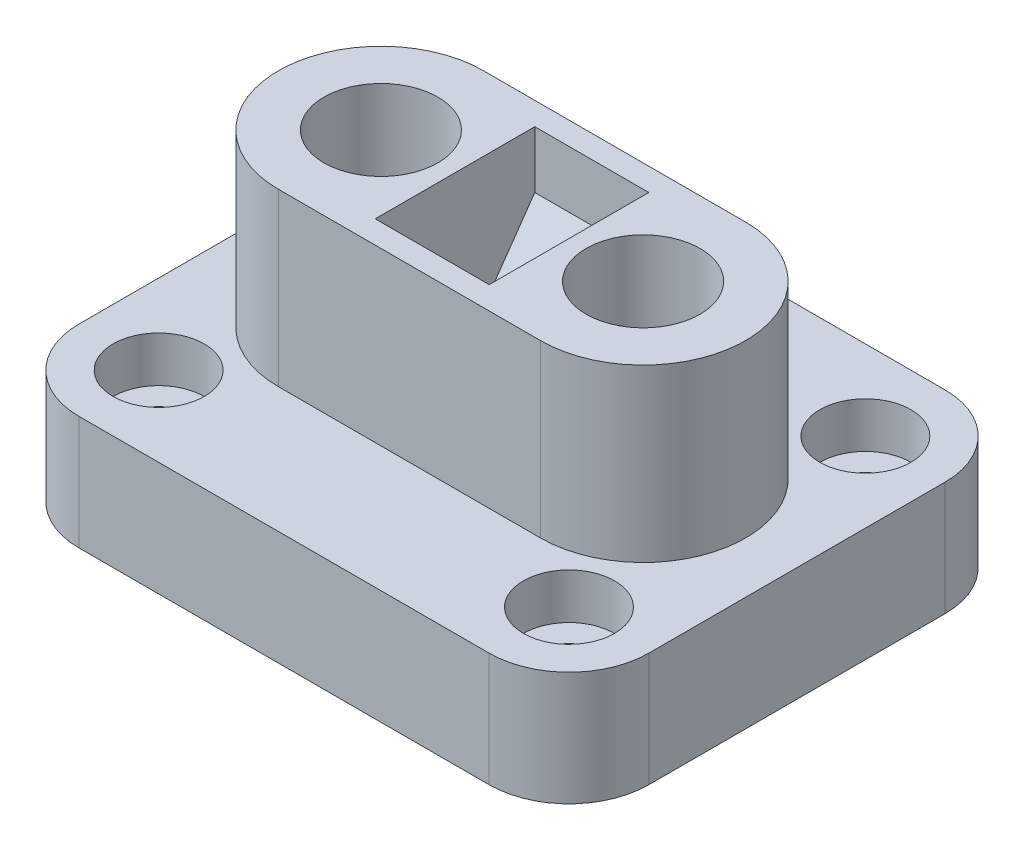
ISO-10303-21;
HEADER;
FILE_DESCRIPTION(('STEP AP214'),'2;1');
FILE_NAME('part.step','',(''),(''),'','','');
FILE_SCHEMA(('AUTOMOTIVE_DESIGN { 1 0 10303 214 1 1 1 1 }'));
ENDSEC;
DATA;
#1=APPLICATION_CONTEXT('core data for automotive mechanical design processes');
#2=APPLICATION_PROTOCOL_DEFINITION('international standard','automotive_design',2000,#1);
#3=PRODUCT_CONTEXT('',#1,'mechanical');
#4=PRODUCT('Part','Part','',(#3));
#5=PRODUCT_RELATED_PRODUCT_CATEGORY('part','',(#4));
#6=PRODUCT_DEFINITION_FORMATION('','',#4);
#7=PRODUCT_DEFINITION_CONTEXT('part definition',#1,'design');
#8=PRODUCT_DEFINITION('design','',#6,#7);
#9=PRODUCT_DEFINITION_SHAPE('','',#8);
#10=(LENGTH_UNIT() NAMED_UNIT(*) SI_UNIT(.MILLI.,.METRE.));
#11=(NAMED_UNIT(*) PLANE_ANGLE_UNIT() SI_UNIT($,.RADIAN.));
#12=(NAMED_UNIT(*) SI_UNIT($,.STERADIAN.) SOLID_ANGLE_UNIT());
#13=UNCERTAINTY_MEASURE_WITH_UNIT(LENGTH_MEASURE(1.E-05),#10,'distance_accuracy_value','');
#14=(GEOMETRIC_REPRESENTATION_CONTEXT(3) GLOBAL_UNCERTAINTY_ASSIGNED_CONTEXT((#13)) GLOBAL_UNIT_ASSIGNED_CONTEXT((#10,
#11,#12)) REPRESENTATION_CONTEXT('',''));
#15=CARTESIAN_POINT('',(0.,0.,0.));
#16=DIRECTION('',(0.,0.,1.));
#17=DIRECTION('',(1.,0.,0.));
#18=AXIS2_PLACEMENT_3D('',#15,#16,#17);
#19=CARTESIAN_POINT('',(-50.,20.,40.));
#20=DIRECTION('',(0.,1.,0.));
#21=DIRECTION('',(0.,0.,1.));
#22=AXIS2_PLACEMENT_3D('',#19,#20,#21);
#23=PLANE('',#22);
#24=CARTESIAN_POINT('',(36.,20.,-26.));
#25=DIRECTION('',(0.,1.,0.));
#26=DIRECTION('',(0.,0.,1.));
#27=AXIS2_PLACEMENT_3D('',#24,#25,#26);
#28=CIRCLE('',#27,8.);
#29=CARTESIAN_POINT('',(36.,20.,-18.));
#30=VERTEX_POINT('',#29);
#31=EDGE_CURVE('E228',#30,#30,#28,.T.);
#32=ORIENTED_EDGE('',*,*,#31,.F.);
#33=EDGE_LOOP('',(#32));
#34=FACE_BOUND('',#33,.T.);
#35=CARTESIAN_POINT('',(-36.,20.,-26.));
#36=DIRECTION('',(0.,1.,0.));
#37=DIRECTION('',(0.,0.,1.));
#38=AXIS2_PLACEMENT_3D('',#35,#36,#37);
#39=CIRCLE('',#38,8.);
#40=CARTESIAN_POINT('',(-36.,20.,-18.));
#41=VERTEX_POINT('',#40);
#42=EDGE_CURVE('E251',#41,#41,#39,.T.);
#43=ORIENTED_EDGE('',*,*,#42,.F.);
#44=EDGE_LOOP('',(#43));
#45=FACE_BOUND('',#44,.T.);
#46=CARTESIAN_POINT('',(36.,20.,26.));
#47=DIRECTION('',(0.,1.,0.));
#48=DIRECTION('',(0.,0.,1.));
#49=AXIS2_PLACEMENT_3D('',#46,#47,#48);
#50=CIRCLE('',#49,8.);
#51=CARTESIAN_POINT('',(36.,20.,34.));
#52=VERTEX_POINT('',#51);
#53=EDGE_CURVE('E263',#52,#52,#50,.T.);
#54=ORIENTED_EDGE('',*,*,#53,.F.);
#55=EDGE_LOOP('',(#54));
#56=FACE_BOUND('',#55,.T.);
#57=CARTESIAN_POINT('',(-36.,20.,26.));
#58=DIRECTION('',(0.,1.,0.));
#59=DIRECTION('',(0.,0.,1.));
#60=AXIS2_PLACEMENT_3D('',#57,#58,#59);
#61=CIRCLE('',#60,8.);
#62=CARTESIAN_POINT('',(-36.,20.,34.));
#63=VERTEX_POINT('',#62);
#64=EDGE_CURVE('E275',#63,#63,#61,.T.);
#65=ORIENTED_EDGE('',*,*,#64,.F.);
#66=EDGE_LOOP('',(#65));
#67=FACE_BOUND('',#66,.T.);
#68=DIRECTION('',(-1.,0.,0.));
#69=VECTOR('',#68,1.);
#70=CARTESIAN_POINT('',(-50.,20.,-40.));
#71=LINE('',#70,#69);
#72=CARTESIAN_POINT('',(36.,20.,-40.));
#73=VERTEX_POINT('',#72);
#74=CARTESIAN_POINT('',(-36.,20.,-40.));
#75=VERTEX_POINT('',#74);
#76=EDGE_CURVE('E349',#73,#75,#71,.T.);
#77=ORIENTED_EDGE('',*,*,#76,.T.);
#78=CARTESIAN_POINT('',(-36.,20.,-26.));
#79=DIRECTION('',(0.,1.,0.));
#80=DIRECTION('',(0.,0.,1.));
#81=AXIS2_PLACEMENT_3D('',#78,#79,#80);
#82=CIRCLE('',#81,14.);
#83=CARTESIAN_POINT('',(-50.,20.,-26.));
#84=VERTEX_POINT('',#83);
#85=EDGE_CURVE('E376',#75,#84,#82,.T.);
#86=ORIENTED_EDGE('',*,*,#85,.T.);
#87=DIRECTION('',(0.,0.,1.));
#88=VECTOR('',#87,1.);
#89=CARTESIAN_POINT('',(-50.,20.,-40.));
#90=LINE('',#89,#88);
#91=CARTESIAN_POINT('',(-50.,20.,26.));
#92=VERTEX_POINT('',#91);
#93=EDGE_CURVE('E340',#84,#92,#90,.T.);
#94=ORIENTED_EDGE('',*,*,#93,.T.);
#95=CARTESIAN_POINT('',(-36.,20.,26.));
#96=DIRECTION('',(0.,1.,0.));
#97=DIRECTION('',(0.,0.,1.));
#98=AXIS2_PLACEMENT_3D('',#95,#96,#97);
#99=CIRCLE('',#98,14.);
#100=CARTESIAN_POINT('',(-36.,20.,40.));
#101=VERTEX_POINT('',#100);
#102=EDGE_CURVE('E370',#92,#101,#99,.T.);
#103=ORIENTED_EDGE('',*,*,#102,.T.);
#104=DIRECTION('',(1.,0.,0.));
#105=VECTOR('',#104,1.);
#106=CARTESIAN_POINT('',(-50.,20.,40.));
#107=LINE('',#106,#105);
#108=CARTESIAN_POINT('',(36.,20.,40.));
#109=VERTEX_POINT('',#108);
#110=EDGE_CURVE('E343',#101,#109,#107,.T.);
#111=ORIENTED_EDGE('',*,*,#110,.T.);
#112=CARTESIAN_POINT('',(36.,20.,26.));
#113=DIRECTION('',(0.,1.,0.));
#114=DIRECTION('',(0.,0.,1.));
#115=AXIS2_PLACEMENT_3D('',#112,#113,#114);
#116=CIRCLE('',#115,14.);
#117=CARTESIAN_POINT('',(50.,20.,26.));
#118=VERTEX_POINT('',#117);
#119=EDGE_CURVE('E372',#109,#118,#116,.T.);
#120=ORIENTED_EDGE('',*,*,#119,.T.);
#121=DIRECTION('',(0.,0.,-1.));
#122=VECTOR('',#121,1.);
#123=CARTESIAN_POINT('',(50.,20.,-40.));
#124=LINE('',#123,#122);
#125=CARTESIAN_POINT('',(50.,20.,-26.));
#126=VERTEX_POINT('',#125);
#127=EDGE_CURVE('E346',#118,#126,#124,.T.);
#128=ORIENTED_EDGE('',*,*,#127,.T.);
#129=CARTESIAN_POINT('',(36.,20.,-26.));
#130=DIRECTION('',(0.,1.,0.));
#131=DIRECTION('',(0.,0.,1.));
#132=AXIS2_PLACEMENT_3D('',#129,#130,#131);
#133=CIRCLE('',#132,14.);
#134=EDGE_CURVE('E374',#126,#73,#133,.T.);
#135=ORIENTED_EDGE('',*,*,#134,.T.);
#136=EDGE_LOOP('',(#77,#86,#94,#103,#111,#120,#128,#135));
#137=FACE_BOUND('',#136,.T.);
#138=DIRECTION('',(-1.,0.,0.));
#139=VECTOR('',#138,1.);
#140=CARTESIAN_POINT('',(23.,20.,-18.));
#141=LINE('',#140,#139);
#142=CARTESIAN_POINT('',(23.,20.,-18.));
#143=VERTEX_POINT('',#142);
#144=CARTESIAN_POINT('',(-23.,20.,-18.));
#145=VERTEX_POINT('',#144);
#146=EDGE_CURVE('E302',#143,#145,#141,.T.);
#147=ORIENTED_EDGE('',*,*,#146,.F.);
#148=CARTESIAN_POINT('',(23.,20.,0.));
#149=DIRECTION('',(0.,1.,0.));
#150=DIRECTION('',(0.,0.,1.));
#151=AXIS2_PLACEMENT_3D('',#148,#149,#150);
#152=CIRCLE('',#151,18.);
#153=CARTESIAN_POINT('',(23.,20.,18.));
#154=VERTEX_POINT('',#153);
#155=EDGE_CURVE('E299',#154,#143,#152,.T.);
#156=ORIENTED_EDGE('',*,*,#155,.F.);
#157=DIRECTION('',(1.,0.,0.));
#158=VECTOR('',#157,1.);
#159=CARTESIAN_POINT('',(-23.,20.,18.));
#160=LINE('',#159,#158);
#161=CARTESIAN_POINT('',(-23.,20.,18.));
#162=VERTEX_POINT('',#161);
#163=EDGE_CURVE('E307',#162,#154,#160,.T.);
#164=ORIENTED_EDGE('',*,*,#163,.F.);
#165=CARTESIAN_POINT('',(-23.,20.,0.));
#166=DIRECTION('',(0.,1.,0.));
#167=DIRECTION('',(0.,0.,1.));
#168=AXIS2_PLACEMENT_3D('',#165,#166,#167);
#169=CIRCLE('',#168,18.);
#170=EDGE_CURVE('E304',#145,#162,#169,.T.);
#171=ORIENTED_EDGE('',*,*,#170,.F.);
#172=EDGE_LOOP('',(#147,#156,#164,#171));
#173=FACE_BOUND('',#172,.T.);
#174=ADVANCED_FACE('F34',(#34,#45,#56,#67,#137,#173),#23,.T.);
#175=CARTESIAN_POINT('',(-50.,20.,-40.));
#176=DIRECTION('',(1.,0.,0.));
#177=DIRECTION('',(0.,0.,-1.));
#178=AXIS2_PLACEMENT_3D('',#175,#176,#177);
#179=PLANE('',#178);
#180=ORIENTED_EDGE('',*,*,#93,.F.);
#181=DIRECTION('',(0.,-1.,0.));
#182=VECTOR('',#181,1.);
#183=CARTESIAN_POINT('',(-50.,20.,-26.));
#184=LINE('',#183,#182);
#185=CARTESIAN_POINT('',(-50.,0.,-26.));
#186=VERTEX_POINT('',#185);
#187=EDGE_CURVE('E354',#84,#186,#184,.T.);
#188=ORIENTED_EDGE('',*,*,#187,.T.);
#189=DIRECTION('',(0.,0.,1.));
#190=VECTOR('',#189,1.);
#191=CARTESIAN_POINT('',(-50.,0.,-40.));
#192=LINE('',#191,#190);
#193=CARTESIAN_POINT('',(-50.,0.,26.));
#194=VERTEX_POINT('',#193);
#195=EDGE_CURVE('E328',#186,#194,#192,.T.);
#196=ORIENTED_EDGE('',*,*,#195,.T.);
#197=DIRECTION('',(0.,-1.,0.));
#198=VECTOR('',#197,1.);
#199=CARTESIAN_POINT('',(-50.,20.,26.));
#200=LINE('',#199,#198);
#201=EDGE_CURVE('E352',#194,#92,#200,.F.);
#202=ORIENTED_EDGE('',*,*,#201,.T.);
#203=EDGE_LOOP('',(#180,#188,#196,#202));
#204=FACE_BOUND('',#203,.T.);
#205=ADVANCED_FACE('F36',(#204),#179,.F.);
#206=CARTESIAN_POINT('',(-50.,20.,40.));
#207=DIRECTION('',(0.,0.,-1.));
#208=DIRECTION('',(-1.,0.,0.));
#209=AXIS2_PLACEMENT_3D('',#206,#207,#208);
#210=PLANE('',#209);
#211=DIRECTION('',(1.,0.,0.));
#212=VECTOR('',#211,1.);
#213=CARTESIAN_POINT('',(-50.,0.,40.));
#214=LINE('',#213,#212);
#215=CARTESIAN_POINT('',(-36.,0.,40.));
#216=VERTEX_POINT('',#215);
#217=CARTESIAN_POINT('',(36.,0.,40.));
#218=VERTEX_POINT('',#217);
#219=EDGE_CURVE('E331',#216,#218,#214,.T.);
#220=ORIENTED_EDGE('',*,*,#219,.T.);
#221=DIRECTION('',(0.,-1.,0.));
#222=VECTOR('',#221,1.);
#223=CARTESIAN_POINT('',(36.,20.,40.));
#224=LINE('',#223,#222);
#225=EDGE_CURVE('E11',#218,#109,#224,.F.);
#226=ORIENTED_EDGE('',*,*,#225,.T.);
#227=ORIENTED_EDGE('',*,*,#110,.F.);
#228=DIRECTION('',(0.,-1.,0.));
#229=VECTOR('',#228,1.);
#230=CARTESIAN_POINT('',(-36.,20.,40.));
#231=LINE('',#230,#229);
#232=EDGE_CURVE('E42',#101,#216,#231,.T.);
#233=ORIENTED_EDGE('',*,*,#232,.T.);
#234=EDGE_LOOP('',(#220,#226,#227,#233));
#235=FACE_BOUND('',#234,.T.);
#236=ADVANCED_FACE('F387',(#235),#210,.F.);
#237=CARTESIAN_POINT('',(50.,20.,-40.));
#238=DIRECTION('',(-1.,0.,0.));
#239=DIRECTION('',(0.,0.,1.));
#240=AXIS2_PLACEMENT_3D('',#237,#238,#239);
#241=PLANE('',#240);
#242=DIRECTION('',(0.,0.,-1.));
#243=VECTOR('',#242,1.);
#244=CARTESIAN_POINT('',(50.,0.,-40.));
#245=LINE('',#244,#243);
#246=CARTESIAN_POINT('',(50.,0.,26.));
#247=VERTEX_POINT('',#246);
#248=CARTESIAN_POINT('',(50.,0.,-26.));
#249=VERTEX_POINT('',#248);
#250=EDGE_CURVE('E334',#247,#249,#245,.T.);
#251=ORIENTED_EDGE('',*,*,#250,.T.);
#252=DIRECTION('',(0.,-1.,0.));
#253=VECTOR('',#252,1.);
#254=CARTESIAN_POINT('',(50.,20.,-26.));
#255=LINE('',#254,#253);
#256=EDGE_CURVE('E381',#249,#126,#255,.F.);
#257=ORIENTED_EDGE('',*,*,#256,.T.);
#258=ORIENTED_EDGE('',*,*,#127,.F.);
#259=DIRECTION('',(0.,-1.,0.));
#260=VECTOR('',#259,1.);
#261=CARTESIAN_POINT('',(50.,20.,26.));
#262=LINE('',#261,#260);
#263=EDGE_CURVE('E378',#118,#247,#262,.T.);
#264=ORIENTED_EDGE('',*,*,#263,.T.);
#265=EDGE_LOOP('',(#251,#257,#258,#264));
#266=FACE_BOUND('',#265,.T.);
#267=ADVANCED_FACE('F401',(#266),#241,.F.);
#268=CARTESIAN_POINT('',(-50.,20.,-40.));
#269=DIRECTION('',(0.,0.,1.));
#270=DIRECTION('',(1.,0.,0.));
#271=AXIS2_PLACEMENT_3D('',#268,#269,#270);
#272=PLANE('',#271);
#273=DIRECTION('',(-1.,0.,0.));
#274=VECTOR('',#273,1.);
#275=CARTESIAN_POINT('',(-50.,0.,-40.));
#276=LINE('',#275,#274);
#277=CARTESIAN_POINT('',(36.,0.,-40.));
#278=VERTEX_POINT('',#277);
#279=CARTESIAN_POINT('',(-36.,0.,-40.));
#280=VERTEX_POINT('',#279);
#281=EDGE_CURVE('E337',#278,#280,#276,.T.);
#282=ORIENTED_EDGE('',*,*,#281,.T.);
#283=DIRECTION('',(0.,-1.,0.));
#284=VECTOR('',#283,1.);
#285=CARTESIAN_POINT('',(-36.,20.,-40.));
#286=LINE('',#285,#284);
#287=EDGE_CURVE('E368',#280,#75,#286,.F.);
#288=ORIENTED_EDGE('',*,*,#287,.T.);
#289=ORIENTED_EDGE('',*,*,#76,.F.);
#290=DIRECTION('',(0.,-1.,0.));
#291=VECTOR('',#290,1.);
#292=CARTESIAN_POINT('',(36.,20.,-40.));
#293=LINE('',#292,#291);
#294=EDGE_CURVE('E365',#73,#278,#293,.T.);
#295=ORIENTED_EDGE('',*,*,#294,.T.);
#296=EDGE_LOOP('',(#282,#288,#289,#295));
#297=FACE_BOUND('',#296,.T.);
#298=ADVANCED_FACE('F412',(#297),#272,.F.);
#299=CARTESIAN_POINT('',(-50.,0.,40.));
#300=DIRECTION('',(0.,1.,0.));
#301=DIRECTION('',(0.,0.,1.));
#302=AXIS2_PLACEMENT_3D('',#299,#300,#301);
#303=PLANE('',#302);
#304=DIRECTION('',(1.,0.,0.));
#305=VECTOR('',#304,1.);
#306=CARTESIAN_POINT('',(-10.,0.,0.));
#307=LINE('',#306,#305);
#308=CARTESIAN_POINT('',(-10.,0.,0.));
#309=VERTEX_POINT('',#308);
#310=CARTESIAN_POINT('',(10.,0.,0.));
#311=VERTEX_POINT('',#310);
#312=EDGE_CURVE('E179',#309,#311,#307,.T.);
#313=ORIENTED_EDGE('',*,*,#312,.F.);
#314=DIRECTION('',(0.,0.,-1.));
#315=VECTOR('',#314,1.);
#316=CARTESIAN_POINT('',(-10.,0.,0.));
#317=LINE('',#316,#315);
#318=CARTESIAN_POINT('',(-10.,0.,8.));
#319=VERTEX_POINT('',#318);
#320=EDGE_CURVE('E204',#319,#309,#317,.T.);
#321=ORIENTED_EDGE('',*,*,#320,.F.);
#322=DIRECTION('',(1.,0.,0.));
#323=VECTOR('',#322,1.);
#324=CARTESIAN_POINT('',(-10.,0.,8.));
#325=LINE('',#324,#323);
#326=CARTESIAN_POINT('',(10.,0.,8.));
#327=VERTEX_POINT('',#326);
#328=EDGE_CURVE('E225',#319,#327,#325,.T.);
#329=ORIENTED_EDGE('',*,*,#328,.T.);
#330=DIRECTION('',(0.,0.,-1.));
#331=VECTOR('',#330,1.);
#332=CARTESIAN_POINT('',(10.,0.,0.));
#333=LINE('',#332,#331);
#334=EDGE_CURVE('E189',#327,#311,#333,.T.);
#335=ORIENTED_EDGE('',*,*,#334,.T.);
#336=EDGE_LOOP('',(#313,#321,#329,#335));
#337=FACE_BOUND('',#336,.T.);
#338=CARTESIAN_POINT('',(36.,0.,-26.));
#339=DIRECTION('',(0.,1.,0.));
#340=DIRECTION('',(0.,0.,1.));
#341=AXIS2_PLACEMENT_3D('',#338,#339,#340);
#342=CIRCLE('',#341,3.5);
#343=CARTESIAN_POINT('',(36.,0.,-22.5));
#344=VERTEX_POINT('',#343);
#345=EDGE_CURVE('E242',#344,#344,#342,.T.);
#346=ORIENTED_EDGE('',*,*,#345,.T.);
#347=EDGE_LOOP('',(#346));
#348=FACE_BOUND('',#347,.T.);
#349=CARTESIAN_POINT('',(-36.,0.,-26.));
#350=DIRECTION('',(0.,1.,0.));
#351=DIRECTION('',(0.,0.,1.));
#352=AXIS2_PLACEMENT_3D('',#349,#350,#351);
#353=CIRCLE('',#352,3.5);
#354=CARTESIAN_POINT('',(-36.,0.,-22.5));
#355=VERTEX_POINT('',#354);
#356=EDGE_CURVE('E254',#355,#355,#353,.T.);
#357=ORIENTED_EDGE('',*,*,#356,.T.);
#358=EDGE_LOOP('',(#357));
#359=FACE_BOUND('',#358,.T.);
#360=CARTESIAN_POINT('',(36.,0.,26.));
#361=DIRECTION('',(0.,1.,0.));
#362=DIRECTION('',(0.,0.,1.));
#363=AXIS2_PLACEMENT_3D('',#360,#361,#362);
#364=CIRCLE('',#363,3.5);
#365=CARTESIAN_POINT('',(36.,0.,29.5));
#366=VERTEX_POINT('',#365);
#367=EDGE_CURVE('E266',#366,#366,#364,.T.);
#368=ORIENTED_EDGE('',*,*,#367,.T.);
#369=EDGE_LOOP('',(#368));
#370=FACE_BOUND('',#369,.T.);
#371=CARTESIAN_POINT('',(-36.,0.,26.));
#372=DIRECTION('',(0.,1.,0.));
#373=DIRECTION('',(0.,0.,1.));
#374=AXIS2_PLACEMENT_3D('',#371,#372,#373);
#375=CIRCLE('',#374,3.5);
#376=CARTESIAN_POINT('',(-36.,0.,29.5));
#377=VERTEX_POINT('',#376);
#378=EDGE_CURVE('E284',#377,#377,#375,.T.);
#379=ORIENTED_EDGE('',*,*,#378,.T.);
#380=EDGE_LOOP('',(#379));
#381=FACE_BOUND('',#380,.T.);
#382=CARTESIAN_POINT('',(23.,0.,0.));
#383=DIRECTION('',(0.,1.,0.));
#384=DIRECTION('',(0.,0.,1.));
#385=AXIS2_PLACEMENT_3D('',#382,#383,#384);
#386=CIRCLE('',#385,10.);
#387=CARTESIAN_POINT('',(23.,0.,9.99999999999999));
#388=VERTEX_POINT('',#387);
#389=EDGE_CURVE('E287',#388,#388,#386,.T.);
#390=ORIENTED_EDGE('',*,*,#389,.T.);
#391=EDGE_LOOP('',(#390));
#392=FACE_BOUND('',#391,.T.);
#393=CARTESIAN_POINT('',(-23.,0.,0.));
#394=DIRECTION('',(0.,1.,0.));
#395=DIRECTION('',(0.,0.,1.));
#396=AXIS2_PLACEMENT_3D('',#393,#394,#395);
#397=CIRCLE('',#396,10.);
#398=CARTESIAN_POINT('',(-23.,0.,9.99999999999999));
#399=VERTEX_POINT('',#398);
#400=EDGE_CURVE('E296',#399,#399,#397,.T.);
#401=ORIENTED_EDGE('',*,*,#400,.T.);
#402=EDGE_LOOP('',(#401));
#403=FACE_BOUND('',#402,.T.);
#404=ORIENTED_EDGE('',*,*,#195,.F.);
#405=CARTESIAN_POINT('',(-36.,0.,-26.));
#406=DIRECTION('',(0.,1.,0.));
#407=DIRECTION('',(0.,0.,1.));
#408=AXIS2_PLACEMENT_3D('',#405,#406,#407);
#409=CIRCLE('',#408,14.);
#410=EDGE_CURVE('E363',#186,#280,#409,.F.);
#411=ORIENTED_EDGE('',*,*,#410,.T.);
#412=ORIENTED_EDGE('',*,*,#281,.F.);
#413=CARTESIAN_POINT('',(36.,0.,-26.));
#414=DIRECTION('',(0.,1.,0.));
#415=DIRECTION('',(0.,0.,1.));
#416=AXIS2_PLACEMENT_3D('',#413,#414,#415);
#417=CIRCLE('',#416,14.);
#418=EDGE_CURVE('E361',#278,#249,#417,.F.);
#419=ORIENTED_EDGE('',*,*,#418,.T.);
#420=ORIENTED_EDGE('',*,*,#250,.F.);
#421=CARTESIAN_POINT('',(36.,0.,26.));
#422=DIRECTION('',(0.,1.,0.));
#423=DIRECTION('',(0.,0.,1.));
#424=AXIS2_PLACEMENT_3D('',#421,#422,#423);
#425=CIRCLE('',#424,14.);
#426=EDGE_CURVE('E359',#247,#218,#425,.F.);
#427=ORIENTED_EDGE('',*,*,#426,.T.);
#428=ORIENTED_EDGE('',*,*,#219,.F.);
#429=CARTESIAN_POINT('',(-36.,0.,26.));
#430=DIRECTION('',(0.,1.,0.));
#431=DIRECTION('',(0.,0.,1.));
#432=AXIS2_PLACEMENT_3D('',#429,#430,#431);
#433=CIRCLE('',#432,14.);
#434=EDGE_CURVE('E357',#216,#194,#433,.F.);
#435=ORIENTED_EDGE('',*,*,#434,.T.);
#436=EDGE_LOOP('',(#404,#411,#412,#419,#420,#427,#428,#435));
#437=FACE_BOUND('',#436,.T.);
#438=ADVANCED_FACE('F393',(#337,#348,#359,#370,#381,#392,#403,#437),#303,.F.);
#439=CARTESIAN_POINT('',(23.,50.,0.));
#440=DIRECTION('',(0.,-1.,0.));
#441=DIRECTION('',(0.,0.,-1.));
#442=AXIS2_PLACEMENT_3D('',#439,#440,#441);
#443=CYLINDRICAL_SURFACE('',#442,18.);
#444=ORIENTED_EDGE('',*,*,#155,.T.);
#445=DIRECTION('',(0.,-1.,0.));
#446=VECTOR('',#445,1.);
#447=CARTESIAN_POINT('',(23.,50.,-18.));
#448=LINE('',#447,#446);
#449=CARTESIAN_POINT('',(23.,50.,-18.));
#450=VERTEX_POINT('',#449);
#451=EDGE_CURVE('E326',#450,#143,#448,.T.);
#452=ORIENTED_EDGE('',*,*,#451,.F.);
#453=CARTESIAN_POINT('',(23.,50.,0.));
#454=DIRECTION('',(0.,1.,0.));
#455=DIRECTION('',(0.,0.,1.));
#456=AXIS2_PLACEMENT_3D('',#453,#454,#455);
#457=CIRCLE('',#456,18.);
#458=CARTESIAN_POINT('',(23.,50.,18.));
#459=VERTEX_POINT('',#458);
#460=EDGE_CURVE('E309',#459,#450,#457,.T.);
#461=ORIENTED_EDGE('',*,*,#460,.F.);
#462=DIRECTION('',(0.,-1.,0.));
#463=VECTOR('',#462,1.);
#464=CARTESIAN_POINT('',(23.,50.,18.));
#465=LINE('',#464,#463);
#466=EDGE_CURVE('E318',#459,#154,#465,.T.);
#467=ORIENTED_EDGE('',*,*,#466,.T.);
#468=EDGE_LOOP('',(#444,#452,#461,#467));
#469=FACE_BOUND('',#468,.T.);
#470=ADVANCED_FACE('F468',(#469),#443,.T.);
#471=CARTESIAN_POINT('',(23.,50.,-18.));
#472=DIRECTION('',(0.,0.,1.));
#473=DIRECTION('',(1.,0.,0.));
#474=AXIS2_PLACEMENT_3D('',#471,#472,#473);
#475=PLANE('',#474);
#476=ORIENTED_EDGE('',*,*,#146,.T.);
#477=DIRECTION('',(0.,-1.,0.));
#478=VECTOR('',#477,1.);
#479=CARTESIAN_POINT('',(-23.,50.,-18.));
#480=LINE('',#479,#478);
#481=CARTESIAN_POINT('',(-23.,50.,-18.));
#482=VERTEX_POINT('',#481);
#483=EDGE_CURVE('E323',#482,#145,#480,.T.);
#484=ORIENTED_EDGE('',*,*,#483,.F.);
#485=DIRECTION('',(-1.,0.,0.));
#486=VECTOR('',#485,1.);
#487=CARTESIAN_POINT('',(23.,50.,-18.));
#488=LINE('',#487,#486);
#489=EDGE_CURVE('E312',#450,#482,#488,.T.);
#490=ORIENTED_EDGE('',*,*,#489,.F.);
#491=ORIENTED_EDGE('',*,*,#451,.T.);
#492=EDGE_LOOP('',(#476,#484,#490,#491));
#493=FACE_BOUND('',#492,.T.);
#494=ADVANCED_FACE('F476',(#493),#475,.F.);
#495=CARTESIAN_POINT('',(-23.,50.,0.));
#496=DIRECTION('',(0.,-1.,0.));
#497=DIRECTION('',(0.,0.,-1.));
#498=AXIS2_PLACEMENT_3D('',#495,#496,#497);
#499=CYLINDRICAL_SURFACE('',#498,18.);
#500=ORIENTED_EDGE('',*,*,#170,.T.);
#501=DIRECTION('',(0.,-1.,0.));
#502=VECTOR('',#501,1.);
#503=CARTESIAN_POINT('',(-23.,50.,18.));
#504=LINE('',#503,#502);
#505=CARTESIAN_POINT('',(-23.,50.,18.));
#506=VERTEX_POINT('',#505);
#507=EDGE_CURVE('E321',#506,#162,#504,.T.);
#508=ORIENTED_EDGE('',*,*,#507,.F.);
#509=CARTESIAN_POINT('',(-23.,50.,0.));
#510=DIRECTION('',(0.,1.,0.));
#511=DIRECTION('',(0.,0.,1.));
#512=AXIS2_PLACEMENT_3D('',#509,#510,#511);
#513=CIRCLE('',#512,18.);
#514=EDGE_CURVE('E314',#482,#506,#513,.T.);
#515=ORIENTED_EDGE('',*,*,#514,.F.);
#516=ORIENTED_EDGE('',*,*,#483,.T.);
#517=EDGE_LOOP('',(#500,#508,#515,#516));
#518=FACE_BOUND('',#517,.T.);
#519=ADVANCED_FACE('F483',(#518),#499,.T.);
#520=CARTESIAN_POINT('',(-23.,50.,18.));
#521=DIRECTION('',(0.,0.,-1.));
#522=DIRECTION('',(-1.,0.,0.));
#523=AXIS2_PLACEMENT_3D('',#520,#521,#522);
#524=PLANE('',#523);
#525=ORIENTED_EDGE('',*,*,#163,.T.);
#526=ORIENTED_EDGE('',*,*,#466,.F.);
#527=DIRECTION('',(1.,0.,0.));
#528=VECTOR('',#527,1.);
#529=CARTESIAN_POINT('',(-23.,50.,18.));
#530=LINE('',#529,#528);
#531=EDGE_CURVE('E316',#506,#459,#530,.T.);
#532=ORIENTED_EDGE('',*,*,#531,.F.);
#533=ORIENTED_EDGE('',*,*,#507,.T.);
#534=EDGE_LOOP('',(#525,#526,#532,#533));
#535=FACE_BOUND('',#534,.T.);
#536=ADVANCED_FACE('F491',(#535),#524,.F.);
#537=CARTESIAN_POINT('',(23.,50.,0.));
#538=DIRECTION('',(0.,1.,0.));
#539=DIRECTION('',(0.,0.,1.));
#540=AXIS2_PLACEMENT_3D('',#537,#538,#539);
#541=PLANE('',#540);
#542=DIRECTION('',(0.,0.,1.));
#543=VECTOR('',#542,1.);
#544=CARTESIAN_POINT('',(-10.,50.,14.));
#545=LINE('',#544,#543);
#546=CARTESIAN_POINT('',(-10.,50.,-14.));
#547=VERTEX_POINT('',#546);
#548=CARTESIAN_POINT('',(-10.,50.,14.));
#549=VERTEX_POINT('',#548);
#550=EDGE_CURVE('E213',#547,#549,#545,.T.);
#551=ORIENTED_EDGE('',*,*,#550,.F.);
#552=DIRECTION('',(1.,0.,0.));
#553=VECTOR('',#552,1.);
#554=CARTESIAN_POINT('',(-10.,50.,-14.));
#555=LINE('',#554,#553);
#556=CARTESIAN_POINT('',(10.,50.,-14.));
#557=VERTEX_POINT('',#556);
#558=EDGE_CURVE('E235',#547,#557,#555,.T.);
#559=ORIENTED_EDGE('',*,*,#558,.T.);
#560=DIRECTION('',(0.,0.,1.));
#561=VECTOR('',#560,1.);
#562=CARTESIAN_POINT('',(10.,50.,14.));
#563=LINE('',#562,#561);
#564=CARTESIAN_POINT('',(10.,50.,14.));
#565=VERTEX_POINT('',#564);
#566=EDGE_CURVE('E194',#557,#565,#563,.T.);
#567=ORIENTED_EDGE('',*,*,#566,.T.);
#568=DIRECTION('',(1.,0.,0.));
#569=VECTOR('',#568,1.);
#570=CARTESIAN_POINT('',(-10.,50.,14.));
#571=LINE('',#570,#569);
#572=EDGE_CURVE('E233',#549,#565,#571,.T.);
#573=ORIENTED_EDGE('',*,*,#572,.F.);
#574=EDGE_LOOP('',(#551,#559,#567,#573));
#575=FACE_BOUND('',#574,.T.);
#576=CARTESIAN_POINT('',(23.,50.,0.));
#577=DIRECTION('',(0.,1.,0.));
#578=DIRECTION('',(0.,0.,1.));
#579=AXIS2_PLACEMENT_3D('',#576,#577,#578);
#580=CIRCLE('',#579,10.);
#581=CARTESIAN_POINT('',(23.,50.,9.99999999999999));
#582=VERTEX_POINT('',#581);
#583=EDGE_CURVE('E290',#582,#582,#580,.T.);
#584=ORIENTED_EDGE('',*,*,#583,.F.);
#585=EDGE_LOOP('',(#584));
#586=FACE_BOUND('',#585,.T.);
#587=CARTESIAN_POINT('',(-23.,50.,0.));
#588=DIRECTION('',(0.,1.,0.));
#589=DIRECTION('',(0.,0.,1.));
#590=AXIS2_PLACEMENT_3D('',#587,#588,#589);
#591=CIRCLE('',#590,10.);
#592=CARTESIAN_POINT('',(-23.,50.,9.99999999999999));
#593=VERTEX_POINT('',#592);
#594=EDGE_CURVE('E293',#593,#593,#591,.T.);
#595=ORIENTED_EDGE('',*,*,#594,.F.);
#596=EDGE_LOOP('',(#595));
#597=FACE_BOUND('',#596,.T.);
#598=ORIENTED_EDGE('',*,*,#460,.T.);
#599=ORIENTED_EDGE('',*,*,#489,.T.);
#600=ORIENTED_EDGE('',*,*,#514,.T.);
#601=ORIENTED_EDGE('',*,*,#531,.T.);
#602=EDGE_LOOP('',(#598,#599,#600,#601));
#603=FACE_BOUND('',#602,.T.);
#604=ADVANCED_FACE('F499',(#575,#586,#597,#603),#541,.T.);
#605=CARTESIAN_POINT('',(-23.,0.,0.));
#606=DIRECTION('',(0.,1.,0.));
#607=DIRECTION('',(0.,0.,1.));
#608=AXIS2_PLACEMENT_3D('',#605,#606,#607);
#609=CYLINDRICAL_SURFACE('',#608,10.);
#610=ORIENTED_EDGE('',*,*,#400,.F.);
#611=EDGE_LOOP('',(#610));
#612=FACE_BOUND('',#611,.T.);
#613=ORIENTED_EDGE('',*,*,#594,.T.);
#614=EDGE_LOOP('',(#613));
#615=FACE_BOUND('',#614,.T.);
#616=ADVANCED_FACE('F507',(#612,#615),#609,.F.);
#617=CARTESIAN_POINT('',(23.,0.,0.));
#618=DIRECTION('',(0.,1.,0.));
#619=DIRECTION('',(0.,0.,1.));
#620=AXIS2_PLACEMENT_3D('',#617,#618,#619);
#621=CYLINDRICAL_SURFACE('',#620,10.);
#622=ORIENTED_EDGE('',*,*,#389,.F.);
#623=EDGE_LOOP('',(#622));
#624=FACE_BOUND('',#623,.T.);
#625=ORIENTED_EDGE('',*,*,#583,.T.);
#626=EDGE_LOOP('',(#625));
#627=FACE_BOUND('',#626,.T.);
#628=ADVANCED_FACE('F515',(#624,#627),#621,.F.);
#629=CARTESIAN_POINT('',(-36.,20.,26.));
#630=DIRECTION('',(0.,1.,0.));
#631=DIRECTION('',(0.,0.,1.));
#632=AXIS2_PLACEMENT_3D('',#629,#630,#631);
#633=CYLINDRICAL_SURFACE('',#632,3.5);
#634=ORIENTED_EDGE('',*,*,#378,.F.);
#635=EDGE_LOOP('',(#634));
#636=FACE_BOUND('',#635,.T.);
#637=CARTESIAN_POINT('',(-36.,12.,26.));
#638=DIRECTION('',(0.,1.,0.));
#639=DIRECTION('',(0.,0.,1.));
#640=AXIS2_PLACEMENT_3D('',#637,#638,#639);
#641=CIRCLE('',#640,3.5);
#642=CARTESIAN_POINT('',(-36.,12.,29.5));
#643=VERTEX_POINT('',#642);
#644=EDGE_CURVE('E281',#643,#643,#641,.T.);
#645=ORIENTED_EDGE('',*,*,#644,.T.);
#646=EDGE_LOOP('',(#645));
#647=FACE_BOUND('',#646,.T.);
#648=ADVANCED_FACE('F523',(#636,#647),#633,.F.);
#649=CARTESIAN_POINT('',(-32.5,12.,26.));
#650=DIRECTION('',(0.,-1.,0.));
#651=DIRECTION('',(0.,0.,-1.));
#652=AXIS2_PLACEMENT_3D('',#649,#650,#651);
#653=PLANE('',#652);
#654=ORIENTED_EDGE('',*,*,#644,.F.);
#655=EDGE_LOOP('',(#654));
#656=FACE_BOUND('',#655,.T.);
#657=CARTESIAN_POINT('',(-36.,12.,26.));
#658=DIRECTION('',(0.,1.,0.));
#659=DIRECTION('',(0.,0.,1.));
#660=AXIS2_PLACEMENT_3D('',#657,#658,#659);
#661=CIRCLE('',#660,8.);
#662=CARTESIAN_POINT('',(-36.,12.,34.));
#663=VERTEX_POINT('',#662);
#664=EDGE_CURVE('E278',#663,#663,#661,.T.);
#665=ORIENTED_EDGE('',*,*,#664,.T.);
#666=EDGE_LOOP('',(#665));
#667=FACE_BOUND('',#666,.T.);
#668=ADVANCED_FACE('F531',(#656,#667),#653,.F.);
#669=CARTESIAN_POINT('',(-36.,20.,26.));
#670=DIRECTION('',(0.,1.,0.));
#671=DIRECTION('',(0.,0.,1.));
#672=AXIS2_PLACEMENT_3D('',#669,#670,#671);
#673=CYLINDRICAL_SURFACE('',#672,8.);
#674=ORIENTED_EDGE('',*,*,#664,.F.);
#675=EDGE_LOOP('',(#674));
#676=FACE_BOUND('',#675,.T.);
#677=ORIENTED_EDGE('',*,*,#64,.T.);
#678=EDGE_LOOP('',(#677));
#679=FACE_BOUND('',#678,.T.);
#680=ADVANCED_FACE('F539',(#676,#679),#673,.F.);
#681=CARTESIAN_POINT('',(36.,20.,26.));
#682=DIRECTION('',(0.,1.,0.));
#683=DIRECTION('',(0.,0.,1.));
#684=AXIS2_PLACEMENT_3D('',#681,#682,#683);
#685=CYLINDRICAL_SURFACE('',#684,3.5);
#686=ORIENTED_EDGE('',*,*,#367,.F.);
#687=EDGE_LOOP('',(#686));
#688=FACE_BOUND('',#687,.T.);
#689=CARTESIAN_POINT('',(36.,12.,26.));
#690=DIRECTION('',(0.,1.,0.));
#691=DIRECTION('',(0.,0.,1.));
#692=AXIS2_PLACEMENT_3D('',#689,#690,#691);
#693=CIRCLE('',#692,3.5);
#694=CARTESIAN_POINT('',(36.,12.,29.5));
#695=VERTEX_POINT('',#694);
#696=EDGE_CURVE('E272',#695,#695,#693,.T.);
#697=ORIENTED_EDGE('',*,*,#696,.T.);
#698=EDGE_LOOP('',(#697));
#699=FACE_BOUND('',#698,.T.);
#700=ADVANCED_FACE('F547',(#688,#699),#685,.F.);
#701=CARTESIAN_POINT('',(39.5,12.,26.));
#702=DIRECTION('',(0.,-1.,0.));
#703=DIRECTION('',(0.,0.,-1.));
#704=AXIS2_PLACEMENT_3D('',#701,#702,#703);
#705=PLANE('',#704);
#706=ORIENTED_EDGE('',*,*,#696,.F.);
#707=EDGE_LOOP('',(#706));
#708=FACE_BOUND('',#707,.T.);
#709=CARTESIAN_POINT('',(36.,12.,26.));
#710=DIRECTION('',(0.,1.,0.));
#711=DIRECTION('',(0.,0.,1.));
#712=AXIS2_PLACEMENT_3D('',#709,#710,#711);
#713=CIRCLE('',#712,8.);
#714=CARTESIAN_POINT('',(36.,12.,34.));
#715=VERTEX_POINT('',#714);
#716=EDGE_CURVE('E269',#715,#715,#713,.T.);
#717=ORIENTED_EDGE('',*,*,#716,.T.);
#718=EDGE_LOOP('',(#717));
#719=FACE_BOUND('',#718,.T.);
#720=ADVANCED_FACE('F556',(#708,#719),#705,.F.);
#721=CARTESIAN_POINT('',(36.,20.,26.));
#722=DIRECTION('',(0.,1.,0.));
#723=DIRECTION('',(0.,0.,1.));
#724=AXIS2_PLACEMENT_3D('',#721,#722,#723);
#725=CYLINDRICAL_SURFACE('',#724,8.);
#726=ORIENTED_EDGE('',*,*,#716,.F.);
#727=EDGE_LOOP('',(#726));
#728=FACE_BOUND('',#727,.T.);
#729=ORIENTED_EDGE('',*,*,#53,.T.);
#730=EDGE_LOOP('',(#729));
#731=FACE_BOUND('',#730,.T.);
#732=ADVANCED_FACE('F550',(#728,#731),#725,.F.);
#733=CARTESIAN_POINT('',(-36.,20.,-26.));
#734=DIRECTION('',(0.,1.,0.));
#735=DIRECTION('',(0.,0.,1.));
#736=AXIS2_PLACEMENT_3D('',#733,#734,#735);
#737=CYLINDRICAL_SURFACE('',#736,3.5);
#738=ORIENTED_EDGE('',*,*,#356,.F.);
#739=EDGE_LOOP('',(#738));
#740=FACE_BOUND('',#739,.T.);
#741=CARTESIAN_POINT('',(-36.,12.,-26.));
#742=DIRECTION('',(0.,1.,0.));
#743=DIRECTION('',(0.,0.,1.));
#744=AXIS2_PLACEMENT_3D('',#741,#742,#743);
#745=CIRCLE('',#744,3.5);
#746=CARTESIAN_POINT('',(-36.,12.,-22.5));
#747=VERTEX_POINT('',#746);
#748=EDGE_CURVE('E260',#747,#747,#745,.T.);
#749=ORIENTED_EDGE('',*,*,#748,.T.);
#750=EDGE_LOOP('',(#749));
#751=FACE_BOUND('',#750,.T.);
#752=ADVANCED_FACE('F572',(#740,#751),#737,.F.);
#753=CARTESIAN_POINT('',(-32.5,12.,-26.));
#754=DIRECTION('',(0.,-1.,0.));
#755=DIRECTION('',(0.,0.,-1.));
#756=AXIS2_PLACEMENT_3D('',#753,#754,#755);
#757=PLANE('',#756);
#758=ORIENTED_EDGE('',*,*,#748,.F.);
#759=EDGE_LOOP('',(#758));
#760=FACE_BOUND('',#759,.T.);
#761=CARTESIAN_POINT('',(-36.,12.,-26.));
#762=DIRECTION('',(0.,1.,0.));
#763=DIRECTION('',(0.,0.,1.));
#764=AXIS2_PLACEMENT_3D('',#761,#762,#763);
#765=CIRCLE('',#764,8.);
#766=CARTESIAN_POINT('',(-36.,12.,-18.));
#767=VERTEX_POINT('',#766);
#768=EDGE_CURVE('E257',#767,#767,#765,.T.);
#769=ORIENTED_EDGE('',*,*,#768,.T.);
#770=EDGE_LOOP('',(#769));
#771=FACE_BOUND('',#770,.T.);
#772=ADVANCED_FACE('F580',(#760,#771),#757,.F.);
#773=CARTESIAN_POINT('',(-36.,20.,-26.));
#774=DIRECTION('',(0.,1.,0.));
#775=DIRECTION('',(0.,0.,1.));
#776=AXIS2_PLACEMENT_3D('',#773,#774,#775);
#777=CYLINDRICAL_SURFACE('',#776,8.);
#778=ORIENTED_EDGE('',*,*,#768,.F.);
#779=EDGE_LOOP('',(#778));
#780=FACE_BOUND('',#779,.T.);
#781=ORIENTED_EDGE('',*,*,#42,.T.);
#782=EDGE_LOOP('',(#781));
#783=FACE_BOUND('',#782,.T.);
#784=ADVANCED_FACE('F559',(#780,#783),#777,.F.);
#785=CARTESIAN_POINT('',(36.,20.,-26.));
#786=DIRECTION('',(0.,1.,0.));
#787=DIRECTION('',(0.,0.,1.));
#788=AXIS2_PLACEMENT_3D('',#785,#786,#787);
#789=CYLINDRICAL_SURFACE('',#788,3.5);
#790=ORIENTED_EDGE('',*,*,#345,.F.);
#791=EDGE_LOOP('',(#790));
#792=FACE_BOUND('',#791,.T.);
#793=CARTESIAN_POINT('',(36.,12.,-26.));
#794=DIRECTION('',(0.,1.,0.));
#795=DIRECTION('',(0.,0.,1.));
#796=AXIS2_PLACEMENT_3D('',#793,#794,#795);
#797=CIRCLE('',#796,3.5);
#798=CARTESIAN_POINT('',(36.,12.,-22.5));
#799=VERTEX_POINT('',#798);
#800=EDGE_CURVE('E248',#799,#799,#797,.T.);
#801=ORIENTED_EDGE('',*,*,#800,.T.);
#802=EDGE_LOOP('',(#801));
#803=FACE_BOUND('',#802,.T.);
#804=ADVANCED_FACE('F596',(#792,#803),#789,.F.);
#805=CARTESIAN_POINT('',(39.5,12.,-26.));
#806=DIRECTION('',(0.,-1.,0.));
#807=DIRECTION('',(0.,0.,-1.));
#808=AXIS2_PLACEMENT_3D('',#805,#806,#807);
#809=PLANE('',#808);
#810=ORIENTED_EDGE('',*,*,#800,.F.);
#811=EDGE_LOOP('',(#810));
#812=FACE_BOUND('',#811,.T.);
#813=CARTESIAN_POINT('',(36.,12.,-26.));
#814=DIRECTION('',(0.,1.,0.));
#815=DIRECTION('',(0.,0.,1.));
#816=AXIS2_PLACEMENT_3D('',#813,#814,#815);
#817=CIRCLE('',#816,8.);
#818=CARTESIAN_POINT('',(36.,12.,-18.));
#819=VERTEX_POINT('',#818);
#820=EDGE_CURVE('E245',#819,#819,#817,.T.);
#821=ORIENTED_EDGE('',*,*,#820,.T.);
#822=EDGE_LOOP('',(#821));
#823=FACE_BOUND('',#822,.T.);
#824=ADVANCED_FACE('F604',(#812,#823),#809,.F.);
#825=CARTESIAN_POINT('',(36.,20.,-26.));
#826=DIRECTION('',(0.,1.,0.));
#827=DIRECTION('',(0.,0.,1.));
#828=AXIS2_PLACEMENT_3D('',#825,#826,#827);
#829=CYLINDRICAL_SURFACE('',#828,8.);
#830=ORIENTED_EDGE('',*,*,#820,.F.);
#831=EDGE_LOOP('',(#830));
#832=FACE_BOUND('',#831,.T.);
#833=ORIENTED_EDGE('',*,*,#31,.T.);
#834=EDGE_LOOP('',(#833));
#835=FACE_BOUND('',#834,.T.);
#836=ADVANCED_FACE('F583',(#832,#835),#829,.F.);
#837=CARTESIAN_POINT('',(-36.,20.,-26.));
#838=DIRECTION('',(0.,-1.,0.));
#839=DIRECTION('',(0.,0.,-1.));
#840=AXIS2_PLACEMENT_3D('',#837,#838,#839);
#841=CYLINDRICAL_SURFACE('',#840,14.);
#842=ORIENTED_EDGE('',*,*,#85,.F.);
#843=ORIENTED_EDGE('',*,*,#287,.F.);
#844=ORIENTED_EDGE('',*,*,#410,.F.);
#845=ORIENTED_EDGE('',*,*,#187,.F.);
#846=EDGE_LOOP('',(#842,#843,#844,#845));
#847=FACE_BOUND('',#846,.T.);
#848=ADVANCED_FACE('F417',(#847),#841,.T.);
#849=CARTESIAN_POINT('',(36.,20.,-26.));
#850=DIRECTION('',(0.,-1.,0.));
#851=DIRECTION('',(0.,0.,-1.));
#852=AXIS2_PLACEMENT_3D('',#849,#850,#851);
#853=CYLINDRICAL_SURFACE('',#852,14.);
#854=ORIENTED_EDGE('',*,*,#134,.F.);
#855=ORIENTED_EDGE('',*,*,#256,.F.);
#856=ORIENTED_EDGE('',*,*,#418,.F.);
#857=ORIENTED_EDGE('',*,*,#294,.F.);
#858=EDGE_LOOP('',(#854,#855,#856,#857));
#859=FACE_BOUND('',#858,.T.);
#860=ADVANCED_FACE('F409',(#859),#853,.T.);
#861=CARTESIAN_POINT('',(36.,20.,26.));
#862=DIRECTION('',(0.,-1.,0.));
#863=DIRECTION('',(0.,0.,-1.));
#864=AXIS2_PLACEMENT_3D('',#861,#862,#863);
#865=CYLINDRICAL_SURFACE('',#864,14.);
#866=ORIENTED_EDGE('',*,*,#119,.F.);
#867=ORIENTED_EDGE('',*,*,#225,.F.);
#868=ORIENTED_EDGE('',*,*,#426,.F.);
#869=ORIENTED_EDGE('',*,*,#263,.F.);
#870=EDGE_LOOP('',(#866,#867,#868,#869));
#871=FACE_BOUND('',#870,.T.);
#872=ADVANCED_FACE('F398',(#871),#865,.T.);
#873=CARTESIAN_POINT('',(-36.,20.,26.));
#874=DIRECTION('',(0.,-1.,0.));
#875=DIRECTION('',(0.,0.,-1.));
#876=AXIS2_PLACEMENT_3D('',#873,#874,#875);
#877=CYLINDRICAL_SURFACE('',#876,14.);
#878=ORIENTED_EDGE('',*,*,#102,.F.);
#879=ORIENTED_EDGE('',*,*,#201,.F.);
#880=ORIENTED_EDGE('',*,*,#434,.F.);
#881=ORIENTED_EDGE('',*,*,#232,.F.);
#882=EDGE_LOOP('',(#878,#879,#880,#881));
#883=FACE_BOUND('',#882,.T.);
#884=ADVANCED_FACE('F421',(#883),#877,.T.);
#885=CARTESIAN_POINT('',(-10.,0.,8.));
#886=DIRECTION('',(0.,0.,1.));
#887=DIRECTION('',(1.,0.,0.));
#888=AXIS2_PLACEMENT_3D('',#885,#886,#887);
#889=PLANE('',#888);
#890=DIRECTION('',(0.,-1.,0.));
#891=VECTOR('',#890,1.);
#892=CARTESIAN_POINT('',(10.,0.,8.));
#893=LINE('',#892,#891);
#894=CARTESIAN_POINT('',(10.,30.,8.));
#895=VERTEX_POINT('',#894);
#896=EDGE_CURVE('E201',#895,#327,#893,.T.);
#897=ORIENTED_EDGE('',*,*,#896,.T.);
#898=ORIENTED_EDGE('',*,*,#328,.F.);
#899=DIRECTION('',(0.,-1.,0.));
#900=VECTOR('',#899,1.);
#901=CARTESIAN_POINT('',(-10.,0.,8.));
#902=LINE('',#901,#900);
#903=CARTESIAN_POINT('',(-10.,30.,8.));
#904=VERTEX_POINT('',#903);
#905=EDGE_CURVE('E222',#904,#319,#902,.T.);
#906=ORIENTED_EDGE('',*,*,#905,.F.);
#907=DIRECTION('',(1.,0.,0.));
#908=VECTOR('',#907,1.);
#909=CARTESIAN_POINT('',(-10.,30.,8.));
#910=LINE('',#909,#908);
#911=EDGE_CURVE('E229',#904,#895,#910,.T.);
#912=ORIENTED_EDGE('',*,*,#911,.T.);
#913=EDGE_LOOP('',(#897,#898,#906,#912));
#914=FACE_BOUND('',#913,.T.);
#915=ADVANCED_FACE('F423',(#914),#889,.F.);
#916=CARTESIAN_POINT('',(-10.,30.,8.));
#917=DIRECTION('',(0.,-1.,0.));
#918=DIRECTION('',(0.,0.,-1.));
#919=AXIS2_PLACEMENT_3D('',#916,#917,#918);
#920=PLANE('',#919);
#921=DIRECTION('',(0.,0.,-1.));
#922=VECTOR('',#921,1.);
#923=CARTESIAN_POINT('',(10.,30.,8.));
#924=LINE('',#923,#922);
#925=CARTESIAN_POINT('',(10.,30.,14.));
#926=VERTEX_POINT('',#925);
#927=EDGE_CURVE('E198',#926,#895,#924,.T.);
#928=ORIENTED_EDGE('',*,*,#927,.T.);
#929=ORIENTED_EDGE('',*,*,#911,.F.);
#930=DIRECTION('',(0.,0.,-1.));
#931=VECTOR('',#930,1.);
#932=CARTESIAN_POINT('',(-10.,30.,8.));
#933=LINE('',#932,#931);
#934=CARTESIAN_POINT('',(-10.,30.,14.));
#935=VERTEX_POINT('',#934);
#936=EDGE_CURVE('E219',#935,#904,#933,.T.);
#937=ORIENTED_EDGE('',*,*,#936,.F.);
#938=DIRECTION('',(1.,0.,0.));
#939=VECTOR('',#938,1.);
#940=CARTESIAN_POINT('',(-10.,30.,14.));
#941=LINE('',#940,#939);
#942=EDGE_CURVE('E231',#935,#926,#941,.T.);
#943=ORIENTED_EDGE('',*,*,#942,.T.);
#944=EDGE_LOOP('',(#928,#929,#937,#943));
#945=FACE_BOUND('',#944,.T.);
#946=ADVANCED_FACE('F429',(#945),#920,.F.);
#947=CARTESIAN_POINT('',(-10.,30.,14.));
#948=DIRECTION('',(0.,0.,1.));
#949=DIRECTION('',(1.,0.,0.));
#950=AXIS2_PLACEMENT_3D('',#947,#948,#949);
#951=PLANE('',#950);
#952=DIRECTION('',(0.,-1.,0.));
#953=VECTOR('',#952,1.);
#954=CARTESIAN_POINT('',(10.,30.,14.));
#955=LINE('',#954,#953);
#956=EDGE_CURVE('E56',#565,#926,#955,.T.);
#957=ORIENTED_EDGE('',*,*,#956,.T.);
#958=ORIENTED_EDGE('',*,*,#942,.F.);
#959=DIRECTION('',(0.,-1.,0.));
#960=VECTOR('',#959,1.);
#961=CARTESIAN_POINT('',(-10.,30.,14.));
#962=LINE('',#961,#960);
#963=EDGE_CURVE('E216',#549,#935,#962,.T.);
#964=ORIENTED_EDGE('',*,*,#963,.F.);
#965=ORIENTED_EDGE('',*,*,#572,.T.);
#966=EDGE_LOOP('',(#957,#958,#964,#965));
#967=FACE_BOUND('',#966,.T.);
#968=ADVANCED_FACE('F653',(#967),#951,.F.);
#969=CARTESIAN_POINT('',(-10.,50.,-14.));
#970=DIRECTION('',(0.,0.,-1.));
#971=DIRECTION('',(-1.,0.,0.));
#972=AXIS2_PLACEMENT_3D('',#969,#970,#971);
#973=PLANE('',#972);
#974=DIRECTION('',(0.,1.,0.));
#975=VECTOR('',#974,1.);
#976=CARTESIAN_POINT('',(10.,50.,-14.));
#977=LINE('',#976,#975);
#978=CARTESIAN_POINT('',(10.,40.,-14.));
#979=VERTEX_POINT('',#978);
#980=EDGE_CURVE('E184',#979,#557,#977,.T.);
#981=ORIENTED_EDGE('',*,*,#980,.T.);
#982=ORIENTED_EDGE('',*,*,#558,.F.);
#983=DIRECTION('',(0.,1.,0.));
#984=VECTOR('',#983,1.);
#985=CARTESIAN_POINT('',(-10.,50.,-14.));
#986=LINE('',#985,#984);
#987=CARTESIAN_POINT('',(-10.,40.,-14.));
#988=VERTEX_POINT('',#987);
#989=EDGE_CURVE('E210',#988,#547,#986,.T.);
#990=ORIENTED_EDGE('',*,*,#989,.F.);
#991=DIRECTION('',(1.,0.,0.));
#992=VECTOR('',#991,1.);
#993=CARTESIAN_POINT('',(-10.,40.,-14.));
#994=LINE('',#993,#992);
#995=EDGE_CURVE('E178',#988,#979,#994,.T.);
#996=ORIENTED_EDGE('',*,*,#995,.T.);
#997=EDGE_LOOP('',(#981,#982,#990,#996));
#998=FACE_BOUND('',#997,.T.);
#999=ADVANCED_FACE('F662',(#998),#973,.F.);
#1000=CARTESIAN_POINT('',(-10.,40.,-14.));
#1001=DIRECTION('',(0.,-0.573462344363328,-0.819231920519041));
#1002=DIRECTION('',(0.,0.819231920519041,-0.573462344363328));
#1003=AXIS2_PLACEMENT_3D('',#1000,#1001,#1002);
#1004=PLANE('',#1003);
#1005=DIRECTION('',(0.,0.819231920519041,-0.573462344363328));
#1006=VECTOR('',#1005,1.);
#1007=CARTESIAN_POINT('',(10.,40.,-14.));
#1008=LINE('',#1007,#1006);
#1009=CARTESIAN_POINT('',(10.,20.,0.));
#1010=VERTEX_POINT('',#1009);
#1011=EDGE_CURVE('E173',#1010,#979,#1008,.T.);
#1012=ORIENTED_EDGE('',*,*,#1011,.T.);
#1013=ORIENTED_EDGE('',*,*,#995,.F.);
#1014=DIRECTION('',(0.,0.819231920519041,-0.573462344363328));
#1015=VECTOR('',#1014,1.);
#1016=CARTESIAN_POINT('',(-10.,40.,-14.));
#1017=LINE('',#1016,#1015);
#1018=CARTESIAN_POINT('',(-10.,20.,0.));
#1019=VERTEX_POINT('',#1018);
#1020=EDGE_CURVE('E175',#1019,#988,#1017,.T.);
#1021=ORIENTED_EDGE('',*,*,#1020,.F.);
#1022=DIRECTION('',(1.,0.,0.));
#1023=VECTOR('',#1022,1.);
#1024=CARTESIAN_POINT('',(-10.,20.,0.));
#1025=LINE('',#1024,#1023);
#1026=EDGE_CURVE('E171',#1019,#1010,#1025,.T.);
#1027=ORIENTED_EDGE('',*,*,#1026,.T.);
#1028=EDGE_LOOP('',(#1012,#1013,#1021,#1027));
#1029=FACE_BOUND('',#1028,.T.);
#1030=ADVANCED_FACE('F172',(#1029),#1004,.F.);
#1031=CARTESIAN_POINT('',(-10.,20.,0.));
#1032=DIRECTION('',(0.,0.,-1.));
#1033=DIRECTION('',(0.,1.,0.));
#1034=AXIS2_PLACEMENT_3D('',#1031,#1032,#1033);
#1035=PLANE('',#1034);
#1036=DIRECTION('',(0.,1.,0.));
#1037=VECTOR('',#1036,1.);
#1038=CARTESIAN_POINT('',(10.,20.,0.));
#1039=LINE('',#1038,#1037);
#1040=EDGE_CURVE('E49',#311,#1010,#1039,.T.);
#1041=ORIENTED_EDGE('',*,*,#1040,.T.);
#1042=ORIENTED_EDGE('',*,*,#1026,.F.);
#1043=DIRECTION('',(0.,1.,0.));
#1044=VECTOR('',#1043,1.);
#1045=CARTESIAN_POINT('',(-10.,20.,0.));
#1046=LINE('',#1045,#1044);
#1047=EDGE_CURVE('E207',#309,#1019,#1046,.T.);
#1048=ORIENTED_EDGE('',*,*,#1047,.F.);
#1049=ORIENTED_EDGE('',*,*,#312,.T.);
#1050=EDGE_LOOP('',(#1041,#1042,#1048,#1049));
#1051=FACE_BOUND('',#1050,.T.);
#1052=ADVANCED_FACE('F186',(#1051),#1035,.F.);
#1053=CARTESIAN_POINT('',(-10.,0.,8.));
#1054=DIRECTION('',(-1.,0.,0.));
#1055=DIRECTION('',(0.,0.,1.));
#1056=AXIS2_PLACEMENT_3D('',#1053,#1054,#1055);
#1057=PLANE('',#1056);
#1058=ORIENTED_EDGE('',*,*,#320,.T.);
#1059=ORIENTED_EDGE('',*,*,#1047,.T.);
#1060=ORIENTED_EDGE('',*,*,#1020,.T.);
#1061=ORIENTED_EDGE('',*,*,#989,.T.);
#1062=ORIENTED_EDGE('',*,*,#550,.T.);
#1063=ORIENTED_EDGE('',*,*,#963,.T.);
#1064=ORIENTED_EDGE('',*,*,#936,.T.);
#1065=ORIENTED_EDGE('',*,*,#905,.T.);
#1066=EDGE_LOOP('',(#1058,#1059,#1060,#1061,#1062,#1063,#1064,#1065));
#1067=FACE_BOUND('',#1066,.T.);
#1068=ADVANCED_FACE('F686',(#1067),#1057,.F.);
#1069=CARTESIAN_POINT('',(10.,0.,8.));
#1070=DIRECTION('',(-1.,0.,0.));
#1071=DIRECTION('',(0.,0.,1.));
#1072=AXIS2_PLACEMENT_3D('',#1069,#1070,#1071);
#1073=PLANE('',#1072);
#1074=ORIENTED_EDGE('',*,*,#334,.F.);
#1075=ORIENTED_EDGE('',*,*,#896,.F.);
#1076=ORIENTED_EDGE('',*,*,#927,.F.);
#1077=ORIENTED_EDGE('',*,*,#956,.F.);
#1078=ORIENTED_EDGE('',*,*,#566,.F.);
#1079=ORIENTED_EDGE('',*,*,#980,.F.);
#1080=ORIENTED_EDGE('',*,*,#1011,.F.);
#1081=ORIENTED_EDGE('',*,*,#1040,.F.);
#1082=EDGE_LOOP('',(#1074,#1075,#1076,#1077,#1078,#1079,#1080,#1081));
#1083=FACE_BOUND('',#1082,.T.);
#1084=ADVANCED_FACE('F182',(#1083),#1073,.T.);
#1085=CLOSED_SHELL('',(#174,#205,#236,#267,#298,#438,#470,#494,#519,#536,#604,#616,#628,#648,
#668,#680,#700,#720,#732,#752,#772,#784,#804,#824,#836,#848,#860,#872,#884,#915,#946,#968,#999,
#1030,#1052,#1068,#1084));
#1086=MANIFOLD_SOLID_BREP('B2',#1085);
#1087=ADVANCED_BREP_SHAPE_REPRESENTATION('',(#18,#1086),#14);
#1088=SHAPE_DEFINITION_REPRESENTATION(#9,#1087);
ENDSEC;
END-ISO-10303-21;
